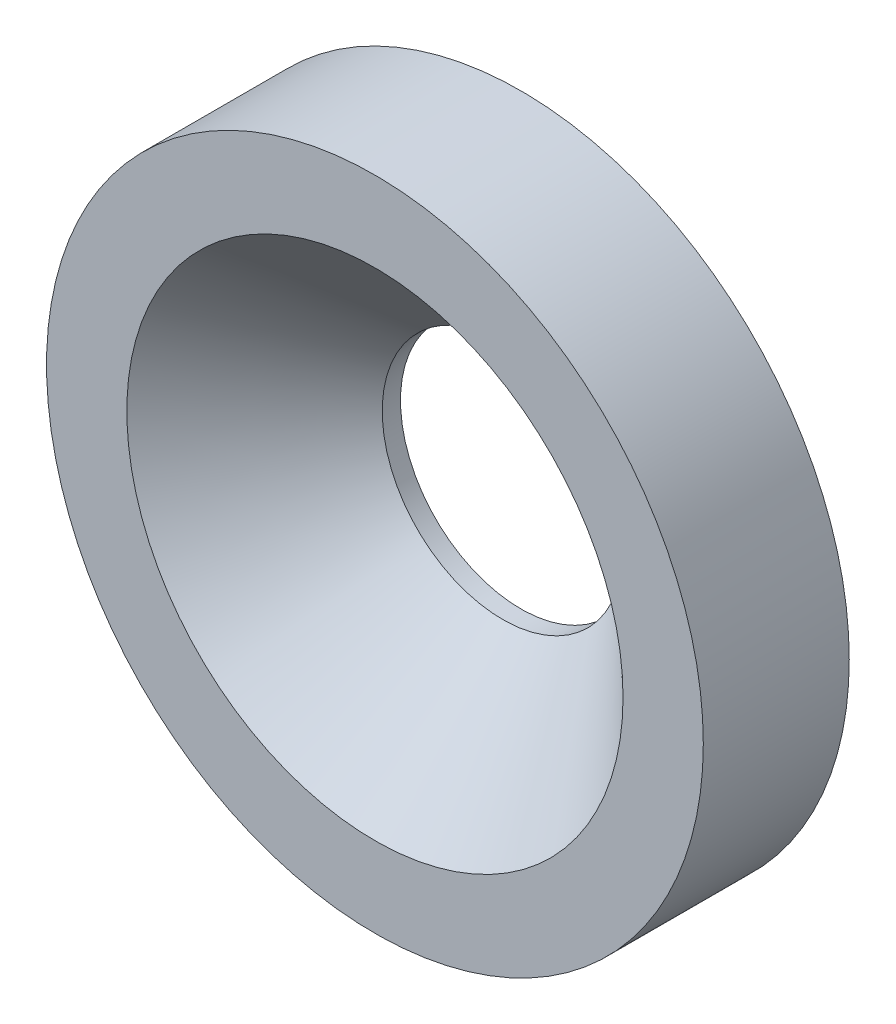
ISO-10303-21;
HEADER;
FILE_DESCRIPTION(('STEP AP214'),'2;1');
FILE_NAME('part.step','',(''),(''),'','','');
FILE_SCHEMA(('AUTOMOTIVE_DESIGN { 1 0 10303 214 1 1 1 1 }'));
ENDSEC;
DATA;
#1=APPLICATION_CONTEXT('core data for automotive mechanical design processes');
#2=APPLICATION_PROTOCOL_DEFINITION('international standard','automotive_design',2000,#1);
#3=PRODUCT_CONTEXT('',#1,'mechanical');
#4=PRODUCT('Part','Part','',(#3));
#5=PRODUCT_RELATED_PRODUCT_CATEGORY('part','',(#4));
#6=PRODUCT_DEFINITION_FORMATION('','',#4);
#7=PRODUCT_DEFINITION_CONTEXT('part definition',#1,'design');
#8=PRODUCT_DEFINITION('design','',#6,#7);
#9=PRODUCT_DEFINITION_SHAPE('','',#8);
#10=(LENGTH_UNIT() NAMED_UNIT(*) SI_UNIT(.MILLI.,.METRE.));
#11=(NAMED_UNIT(*) PLANE_ANGLE_UNIT() SI_UNIT($,.RADIAN.));
#12=(NAMED_UNIT(*) SI_UNIT($,.STERADIAN.) SOLID_ANGLE_UNIT());
#13=UNCERTAINTY_MEASURE_WITH_UNIT(LENGTH_MEASURE(1.E-05),#10,'distance_accuracy_value','');
#14=(GEOMETRIC_REPRESENTATION_CONTEXT(3) GLOBAL_UNCERTAINTY_ASSIGNED_CONTEXT((#13)) GLOBAL_UNIT_ASSIGNED_CONTEXT((#10,
#11,#12)) REPRESENTATION_CONTEXT('',''));
#15=CARTESIAN_POINT('',(0.,0.,0.));
#16=DIRECTION('',(0.,0.,1.));
#17=DIRECTION('',(1.,0.,0.));
#18=AXIS2_PLACEMENT_3D('',#15,#16,#17);
#19=CARTESIAN_POINT('',(0.,0.,4.00000000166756));
#20=DIRECTION('',(0.,0.,1.));
#21=DIRECTION('',(1.,0.,0.));
#22=AXIS2_PLACEMENT_3D('',#19,#20,#21);
#23=CONICAL_SURFACE('',#22,6.79999999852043,0.785398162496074);
#24=CARTESIAN_POINT('',(0.,0.,4.00000000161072));
#25=DIRECTION('',(0.,0.,1.));
#26=DIRECTION('',(1.,0.,0.));
#27=AXIS2_PLACEMENT_3D('',#24,#25,#26);
#28=CIRCLE('',#27,6.79999999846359);
#29=CARTESIAN_POINT('',(6.79999999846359,0.,4.00000000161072));
#30=VERTEX_POINT('',#29);
#31=EDGE_CURVE('E17',#30,#30,#28,.T.);
#32=ORIENTED_EDGE('',*,*,#31,.T.);
#33=EDGE_LOOP('',(#32));
#34=FACE_BOUND('',#33,.T.);
#35=CARTESIAN_POINT('',(0.,0.,0.5));
#36=DIRECTION('',(0.,0.,1.));
#37=DIRECTION('',(1.,0.,0.));
#38=AXIS2_PLACEMENT_3D('',#35,#36,#37);
#39=CIRCLE('',#38,3.3);
#40=CARTESIAN_POINT('',(3.3,0.,0.5));
#41=VERTEX_POINT('',#40);
#42=EDGE_CURVE('E35',#41,#41,#39,.F.);
#43=ORIENTED_EDGE('',*,*,#42,.T.);
#44=EDGE_LOOP('',(#43));
#45=FACE_BOUND('',#44,.T.);
#46=ADVANCED_FACE('F14',(#34,#45),#23,.F.);
#47=CARTESIAN_POINT('',(0.,0.,0.));
#48=DIRECTION('',(0.,0.,1.));
#49=DIRECTION('',(1.,0.,0.));
#50=AXIS2_PLACEMENT_3D('',#47,#48,#49);
#51=CYLINDRICAL_SURFACE('',#50,3.3);
#52=ORIENTED_EDGE('',*,*,#42,.F.);
#53=EDGE_LOOP('',(#52));
#54=FACE_BOUND('',#53,.T.);
#55=CARTESIAN_POINT('',(0.,0.,0.));
#56=DIRECTION('',(0.,0.,1.));
#57=DIRECTION('',(1.,0.,0.));
#58=AXIS2_PLACEMENT_3D('',#55,#56,#57);
#59=CIRCLE('',#58,3.3);
#60=CARTESIAN_POINT('',(3.3,0.,0.));
#61=VERTEX_POINT('',#60);
#62=EDGE_CURVE('E26',#61,#61,#59,.T.);
#63=ORIENTED_EDGE('',*,*,#62,.F.);
#64=EDGE_LOOP('',(#63));
#65=FACE_BOUND('',#64,.T.);
#66=ADVANCED_FACE('F42',(#54,#65),#51,.F.);
#67=CARTESIAN_POINT('',(0.,0.,4.));
#68=DIRECTION('',(0.,0.,-1.));
#69=DIRECTION('',(-1.,0.,0.));
#70=AXIS2_PLACEMENT_3D('',#67,#68,#69);
#71=PLANE('',#70);
#72=ORIENTED_EDGE('',*,*,#31,.F.);
#73=EDGE_LOOP('',(#72));
#74=FACE_BOUND('',#73,.T.);
#75=CARTESIAN_POINT('',(0.,0.,4.));
#76=DIRECTION('',(0.,0.,1.));
#77=DIRECTION('',(1.,0.,0.));
#78=AXIS2_PLACEMENT_3D('',#75,#76,#77);
#79=CIRCLE('',#78,9.);
#80=CARTESIAN_POINT('',(9.,0.,4.));
#81=VERTEX_POINT('',#80);
#82=EDGE_CURVE('E21',#81,#81,#79,.F.);
#83=ORIENTED_EDGE('',*,*,#82,.F.);
#84=EDGE_LOOP('',(#83));
#85=FACE_BOUND('',#84,.T.);
#86=ADVANCED_FACE('F45',(#74,#85),#71,.F.);
#87=CARTESIAN_POINT('',(0.,0.,0.));
#88=DIRECTION('',(0.,0.,-1.));
#89=DIRECTION('',(-1.,0.,0.));
#90=AXIS2_PLACEMENT_3D('',#87,#88,#89);
#91=PLANE('',#90);
#92=ORIENTED_EDGE('',*,*,#62,.T.);
#93=EDGE_LOOP('',(#92));
#94=FACE_BOUND('',#93,.T.);
#95=CARTESIAN_POINT('',(0.,0.,0.));
#96=DIRECTION('',(0.,0.,1.));
#97=DIRECTION('',(1.,0.,0.));
#98=AXIS2_PLACEMENT_3D('',#95,#96,#97);
#99=CIRCLE('',#98,9.);
#100=CARTESIAN_POINT('',(9.,0.,0.));
#101=VERTEX_POINT('',#100);
#102=EDGE_CURVE('E10',#101,#101,#99,.T.);
#103=ORIENTED_EDGE('',*,*,#102,.F.);
#104=EDGE_LOOP('',(#103));
#105=FACE_BOUND('',#104,.T.);
#106=ADVANCED_FACE('F51',(#94,#105),#91,.T.);
#107=CARTESIAN_POINT('',(0.,0.,0.));
#108=DIRECTION('',(0.,0.,1.));
#109=DIRECTION('',(1.,0.,0.));
#110=AXIS2_PLACEMENT_3D('',#107,#108,#109);
#111=CYLINDRICAL_SURFACE('',#110,9.);
#112=ORIENTED_EDGE('',*,*,#102,.T.);
#113=EDGE_LOOP('',(#112));
#114=FACE_BOUND('',#113,.T.);
#115=ORIENTED_EDGE('',*,*,#82,.T.);
#116=EDGE_LOOP('',(#115));
#117=FACE_BOUND('',#116,.T.);
#118=ADVANCED_FACE('F54',(#114,#117),#111,.T.);
#119=CLOSED_SHELL('',(#46,#66,#86,#106,#118));
#120=MANIFOLD_SOLID_BREP('B1',#119);
#121=ADVANCED_BREP_SHAPE_REPRESENTATION('',(#18,#120),#14);
#122=SHAPE_DEFINITION_REPRESENTATION(#9,#121);
ENDSEC;
END-ISO-10303-21;
